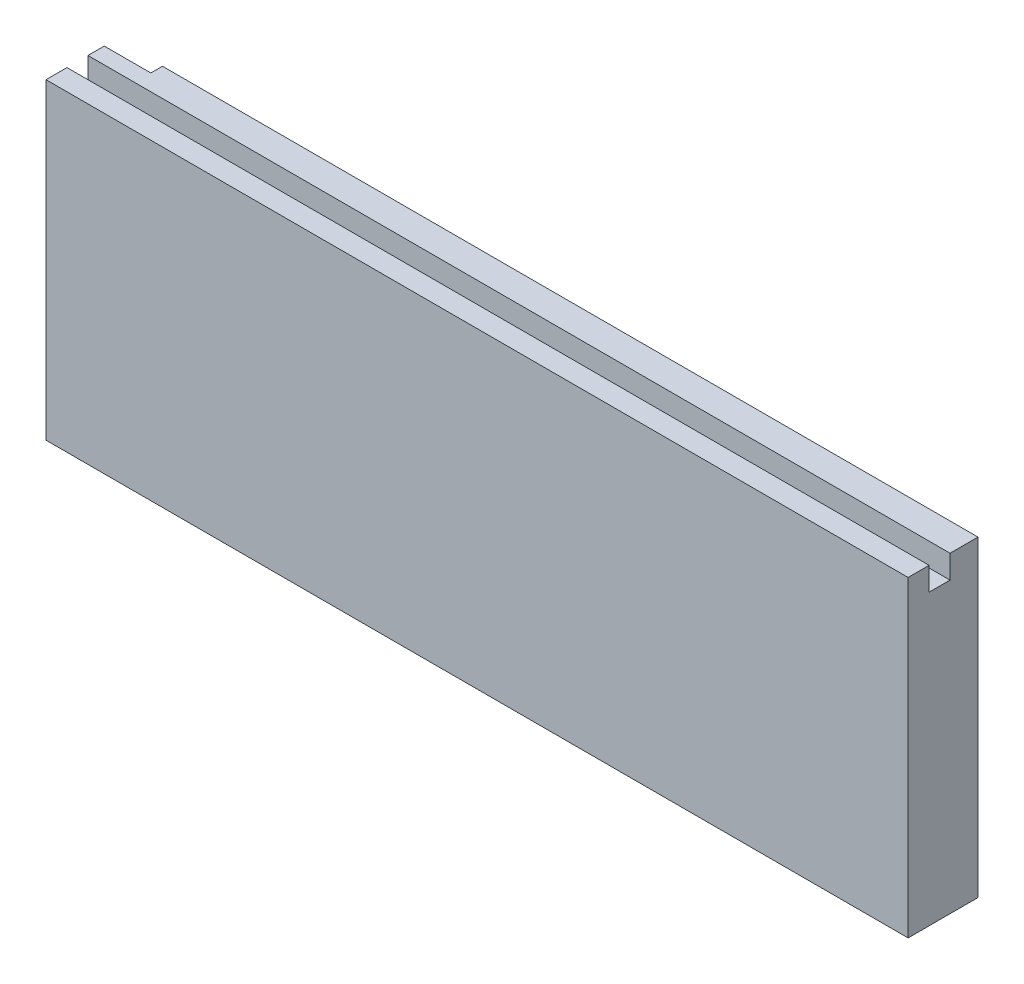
ISO-10303-21;
HEADER;
FILE_DESCRIPTION(('STEP AP214'),'2;1');
FILE_NAME('part.step','',(''),(''),'','','');
FILE_SCHEMA(('AUTOMOTIVE_DESIGN { 1 0 10303 214 1 1 1 1 }'));
ENDSEC;
DATA;
#1=APPLICATION_CONTEXT('core data for automotive mechanical design processes');
#2=APPLICATION_PROTOCOL_DEFINITION('international standard','automotive_design',2000,#1);
#3=PRODUCT_CONTEXT('',#1,'mechanical');
#4=PRODUCT('Part','Part','',(#3));
#5=PRODUCT_RELATED_PRODUCT_CATEGORY('part','',(#4));
#6=PRODUCT_DEFINITION_FORMATION('','',#4);
#7=PRODUCT_DEFINITION_CONTEXT('part definition',#1,'design');
#8=PRODUCT_DEFINITION('design','',#6,#7);
#9=PRODUCT_DEFINITION_SHAPE('','',#8);
#10=(LENGTH_UNIT() NAMED_UNIT(*) SI_UNIT(.MILLI.,.METRE.));
#11=(NAMED_UNIT(*) PLANE_ANGLE_UNIT() SI_UNIT($,.RADIAN.));
#12=(NAMED_UNIT(*) SI_UNIT($,.STERADIAN.) SOLID_ANGLE_UNIT());
#13=UNCERTAINTY_MEASURE_WITH_UNIT(LENGTH_MEASURE(1.E-05),#10,'distance_accuracy_value','');
#14=(GEOMETRIC_REPRESENTATION_CONTEXT(3) GLOBAL_UNCERTAINTY_ASSIGNED_CONTEXT((#13)) GLOBAL_UNIT_ASSIGNED_CONTEXT((#10,
#11,#12)) REPRESENTATION_CONTEXT('',''));
#15=CARTESIAN_POINT('',(0.,0.,0.));
#16=DIRECTION('',(0.,0.,1.));
#17=DIRECTION('',(1.,0.,0.));
#18=AXIS2_PLACEMENT_3D('',#15,#16,#17);
#19=CARTESIAN_POINT('',(0.,49.,38.6780056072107));
#20=CARTESIAN_POINT('',(3.15506832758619,52.1550683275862,38.6780056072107));
#21=CARTESIAN_POINT('',(8.94329847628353,59.3030415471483,38.6780056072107));
#22=CARTESIAN_POINT('',(15.9633545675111,62.,38.6780056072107));
#23=CARTESIAN_POINT('',(25.,62.,38.6780056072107));
#24=B_SPLINE_CURVE_WITH_KNOTS('',3,(#19,#20,#21,#22,#23),.UNSPECIFIED.,.F.,.F.,(4,1,4),(0.,
0.382763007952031,1.),.UNSPECIFIED.);
#25=DIRECTION('',(0.,0.,-1.));
#26=VECTOR('',#25,1.);
#27=SURFACE_OF_LINEAR_EXTRUSION('',#24,#26);
#28=CARTESIAN_POINT('',(0.,49.,6.));
#29=CARTESIAN_POINT('',(3.15506832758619,52.1550683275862,6.));
#30=CARTESIAN_POINT('',(8.94329847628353,59.3030415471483,6.));
#31=CARTESIAN_POINT('',(15.9633545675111,62.,6.));
#32=CARTESIAN_POINT('',(25.,62.,6.));
#33=B_SPLINE_CURVE_WITH_KNOTS('',3,(#28,#29,#30,#31,#32),.UNSPECIFIED.,.F.,.F.,(4,1,4),(0.,
0.382763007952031,1.),.UNSPECIFIED.);
#34=CARTESIAN_POINT('',(16.8108976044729,61.3394728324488,6.));
#35=VERTEX_POINT('',#34);
#36=CARTESIAN_POINT('',(25.,62.,6.));
#37=VERTEX_POINT('',#36);
#38=EDGE_CURVE('E133',#35,#37,#33,.T.);
#39=ORIENTED_EDGE('',*,*,#38,.F.);
#40=DIRECTION('',(0.,0.,-1.));
#41=VECTOR('',#40,1.);
#42=CARTESIAN_POINT('',(16.8108976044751,61.3394728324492,10.5));
#43=LINE('',#42,#41);
#44=CARTESIAN_POINT('',(16.8108976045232,61.3394728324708,10.5));
#45=VERTEX_POINT('',#44);
#46=EDGE_CURVE('E11',#35,#45,#43,.F.);
#47=ORIENTED_EDGE('',*,*,#46,.T.);
#48=CARTESIAN_POINT('',(0.,49.,10.5));
#49=CARTESIAN_POINT('',(3.15506832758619,52.1550683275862,10.5));
#50=CARTESIAN_POINT('',(8.94329847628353,59.3030415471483,10.5));
#51=CARTESIAN_POINT('',(15.9633545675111,62.,10.5));
#52=CARTESIAN_POINT('',(25.,62.,10.5));
#53=B_SPLINE_CURVE_WITH_KNOTS('',3,(#48,#49,#50,#51,#52),.UNSPECIFIED.,.F.,.F.,(4,1,4),(0.,
0.382763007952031,1.),.UNSPECIFIED.);
#54=CARTESIAN_POINT('',(25.,62.,10.5));
#55=VERTEX_POINT('',#54);
#56=EDGE_CURVE('E138',#45,#55,#53,.T.);
#57=ORIENTED_EDGE('',*,*,#56,.T.);
#58=DIRECTION('',(0.,0.,-1.));
#59=VECTOR('',#58,1.);
#60=CARTESIAN_POINT('',(25.,62.,38.6780056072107));
#61=LINE('',#60,#59);
#62=EDGE_CURVE('E267',#55,#37,#61,.T.);
#63=ORIENTED_EDGE('',*,*,#62,.T.);
#64=EDGE_LOOP('',(#39,#47,#57,#63));
#65=FACE_BOUND('',#64,.T.);
#66=ADVANCED_FACE('F33',(#65),#27,.T.);
#67=CARTESIAN_POINT('',(0.,62.,6.));
#68=DIRECTION('',(0.,-1.,0.));
#69=DIRECTION('',(0.,0.,-1.));
#70=AXIS2_PLACEMENT_3D('',#67,#68,#69);
#71=PLANE('',#70);
#72=ORIENTED_EDGE('',*,*,#62,.F.);
#73=DIRECTION('',(1.,0.,0.));
#74=VECTOR('',#73,1.);
#75=CARTESIAN_POINT('',(0.,62.,10.5));
#76=LINE('',#75,#74);
#77=CARTESIAN_POINT('',(185.,62.,10.5));
#78=VERTEX_POINT('',#77);
#79=EDGE_CURVE('E183',#55,#78,#76,.T.);
#80=ORIENTED_EDGE('',*,*,#79,.T.);
#81=DIRECTION('',(0.,0.,-1.));
#82=VECTOR('',#81,1.);
#83=CARTESIAN_POINT('',(185.,62.,6.));
#84=LINE('',#83,#82);
#85=CARTESIAN_POINT('',(185.,62.,6.));
#86=VERTEX_POINT('',#85);
#87=EDGE_CURVE('E173',#78,#86,#84,.T.);
#88=ORIENTED_EDGE('',*,*,#87,.T.);
#89=DIRECTION('',(1.,0.,0.));
#90=VECTOR('',#89,1.);
#91=CARTESIAN_POINT('',(0.,62.,6.));
#92=LINE('',#91,#90);
#93=EDGE_CURVE('E181',#37,#86,#92,.T.);
#94=ORIENTED_EDGE('',*,*,#93,.F.);
#95=EDGE_LOOP('',(#72,#80,#88,#94));
#96=FACE_BOUND('',#95,.T.);
#97=ADVANCED_FACE('F156',(#96),#71,.F.);
#98=CARTESIAN_POINT('',(0.,67.,15.));
#99=DIRECTION('',(0.,-1.,0.));
#100=DIRECTION('',(0.,0.,-1.));
#101=AXIS2_PLACEMENT_3D('',#98,#99,#100);
#102=PLANE('',#101);
#103=DIRECTION('',(0.,0.,-1.));
#104=VECTOR('',#103,1.);
#105=CARTESIAN_POINT('',(0.,67.,15.));
#106=LINE('',#105,#104);
#107=CARTESIAN_POINT('',(0.,67.,6.));
#108=VERTEX_POINT('',#107);
#109=CARTESIAN_POINT('',(0.,67.,2.5));
#110=VERTEX_POINT('',#109);
#111=EDGE_CURVE('E214',#108,#110,#106,.T.);
#112=ORIENTED_EDGE('',*,*,#111,.F.);
#113=DIRECTION('',(1.,0.,0.));
#114=VECTOR('',#113,1.);
#115=CARTESIAN_POINT('',(0.,67.,6.));
#116=LINE('',#115,#114);
#117=CARTESIAN_POINT('',(185.,67.,6.));
#118=VERTEX_POINT('',#117);
#119=EDGE_CURVE('E177',#108,#118,#116,.T.);
#120=ORIENTED_EDGE('',*,*,#119,.T.);
#121=DIRECTION('',(0.,0.,-1.));
#122=VECTOR('',#121,1.);
#123=CARTESIAN_POINT('',(185.,67.,15.));
#124=LINE('',#123,#122);
#125=CARTESIAN_POINT('',(185.,67.,0.));
#126=VERTEX_POINT('',#125);
#127=EDGE_CURVE('E222',#118,#126,#124,.T.);
#128=ORIENTED_EDGE('',*,*,#127,.T.);
#129=DIRECTION('',(-1.,0.,0.));
#130=VECTOR('',#129,1.);
#131=CARTESIAN_POINT('',(0.,67.,0.));
#132=LINE('',#131,#130);
#133=CARTESIAN_POINT('',(10.,67.,0.));
#134=VERTEX_POINT('',#133);
#135=EDGE_CURVE('E208',#126,#134,#132,.T.);
#136=ORIENTED_EDGE('',*,*,#135,.T.);
#137=DIRECTION('',(0.,0.,-1.));
#138=VECTOR('',#137,1.);
#139=CARTESIAN_POINT('',(10.,67.,2.5));
#140=LINE('',#139,#138);
#141=CARTESIAN_POINT('',(10.,67.,2.5));
#142=VERTEX_POINT('',#141);
#143=EDGE_CURVE('E197',#142,#134,#140,.T.);
#144=ORIENTED_EDGE('',*,*,#143,.F.);
#145=DIRECTION('',(1.,0.,0.));
#146=VECTOR('',#145,1.);
#147=CARTESIAN_POINT('',(0.,67.,2.5));
#148=LINE('',#147,#146);
#149=EDGE_CURVE('E189',#110,#142,#148,.T.);
#150=ORIENTED_EDGE('',*,*,#149,.F.);
#151=EDGE_LOOP('',(#112,#120,#128,#136,#144,#150));
#152=FACE_BOUND('',#151,.T.);
#153=ADVANCED_FACE('F241',(#152),#102,.F.);
#154=CARTESIAN_POINT('',(0.,0.,15.));
#155=DIRECTION('',(1.,0.,0.));
#156=DIRECTION('',(0.,0.,-1.));
#157=AXIS2_PLACEMENT_3D('',#154,#155,#156);
#158=PLANE('',#157);
#159=DIRECTION('',(0.,0.,-1.));
#160=VECTOR('',#159,1.);
#161=CARTESIAN_POINT('',(0.,49.,38.6780056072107));
#162=LINE('',#161,#160);
#163=CARTESIAN_POINT('',(0.,49.,10.5));
#164=VERTEX_POINT('',#163);
#165=CARTESIAN_POINT('',(0.,49.,6.));
#166=VERTEX_POINT('',#165);
#167=EDGE_CURVE('E123',#164,#166,#162,.T.);
#168=ORIENTED_EDGE('',*,*,#167,.T.);
#169=DIRECTION('',(0.,1.,0.));
#170=VECTOR('',#169,1.);
#171=CARTESIAN_POINT('',(0.,67.,6.));
#172=LINE('',#171,#170);
#173=EDGE_CURVE('E127',#166,#108,#172,.T.);
#174=ORIENTED_EDGE('',*,*,#173,.T.);
#175=ORIENTED_EDGE('',*,*,#111,.T.);
#176=DIRECTION('',(0.,1.,0.));
#177=VECTOR('',#176,1.);
#178=CARTESIAN_POINT('',(0.,67.,2.5));
#179=LINE('',#178,#177);
#180=CARTESIAN_POINT('',(0.,0.,2.5));
#181=VERTEX_POINT('',#180);
#182=EDGE_CURVE('E186',#181,#110,#179,.T.);
#183=ORIENTED_EDGE('',*,*,#182,.F.);
#184=DIRECTION('',(0.,0.,-1.));
#185=VECTOR('',#184,1.);
#186=CARTESIAN_POINT('',(0.,0.,15.));
#187=LINE('',#186,#185);
#188=CARTESIAN_POINT('',(0.,0.,15.));
#189=VERTEX_POINT('',#188);
#190=EDGE_CURVE('E41',#189,#181,#187,.T.);
#191=ORIENTED_EDGE('',*,*,#190,.F.);
#192=DIRECTION('',(0.,-1.,0.));
#193=VECTOR('',#192,1.);
#194=CARTESIAN_POINT('',(0.,0.,15.));
#195=LINE('',#194,#193);
#196=CARTESIAN_POINT('',(0.,67.,15.));
#197=VERTEX_POINT('',#196);
#198=EDGE_CURVE('E204',#197,#189,#195,.T.);
#199=ORIENTED_EDGE('',*,*,#198,.F.);
#200=CARTESIAN_POINT('',(0.,67.,10.5));
#201=VERTEX_POINT('',#200);
#202=EDGE_CURVE('E126',#197,#201,#106,.T.);
#203=ORIENTED_EDGE('',*,*,#202,.T.);
#204=DIRECTION('',(0.,-1.,0.));
#205=VECTOR('',#204,1.);
#206=CARTESIAN_POINT('',(0.,62.,10.5));
#207=LINE('',#206,#205);
#208=EDGE_CURVE('E56',#201,#164,#207,.T.);
#209=ORIENTED_EDGE('',*,*,#208,.T.);
#210=EDGE_LOOP('',(#168,#174,#175,#183,#191,#199,#203,#209));
#211=FACE_BOUND('',#210,.T.);
#212=ADVANCED_FACE('F35',(#211),#158,.F.);
#213=CARTESIAN_POINT('',(0.,0.,15.));
#214=DIRECTION('',(0.,1.,0.));
#215=DIRECTION('',(0.,0.,1.));
#216=AXIS2_PLACEMENT_3D('',#213,#214,#215);
#217=PLANE('',#216);
#218=DIRECTION('',(-1.,0.,0.));
#219=VECTOR('',#218,1.);
#220=CARTESIAN_POINT('',(0.,0.,2.5));
#221=LINE('',#220,#219);
#222=CARTESIAN_POINT('',(9.99999999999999,0.,2.5));
#223=VERTEX_POINT('',#222);
#224=EDGE_CURVE('E195',#223,#181,#221,.T.);
#225=ORIENTED_EDGE('',*,*,#224,.F.);
#226=DIRECTION('',(0.,0.,-1.));
#227=VECTOR('',#226,1.);
#228=CARTESIAN_POINT('',(9.99999999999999,0.,2.5));
#229=LINE('',#228,#227);
#230=CARTESIAN_POINT('',(9.99999999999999,0.,0.));
#231=VERTEX_POINT('',#230);
#232=EDGE_CURVE('E199',#223,#231,#229,.T.);
#233=ORIENTED_EDGE('',*,*,#232,.T.);
#234=DIRECTION('',(1.,0.,0.));
#235=VECTOR('',#234,1.);
#236=CARTESIAN_POINT('',(0.,0.,0.));
#237=LINE('',#236,#235);
#238=CARTESIAN_POINT('',(185.,0.,0.));
#239=VERTEX_POINT('',#238);
#240=EDGE_CURVE('E202',#231,#239,#237,.T.);
#241=ORIENTED_EDGE('',*,*,#240,.T.);
#242=DIRECTION('',(0.,0.,-1.));
#243=VECTOR('',#242,1.);
#244=CARTESIAN_POINT('',(185.,0.,15.));
#245=LINE('',#244,#243);
#246=CARTESIAN_POINT('',(185.,0.,15.));
#247=VERTEX_POINT('',#246);
#248=EDGE_CURVE('E226',#247,#239,#245,.T.);
#249=ORIENTED_EDGE('',*,*,#248,.F.);
#250=DIRECTION('',(1.,0.,0.));
#251=VECTOR('',#250,1.);
#252=CARTESIAN_POINT('',(0.,0.,15.));
#253=LINE('',#252,#251);
#254=EDGE_CURVE('E207',#189,#247,#253,.T.);
#255=ORIENTED_EDGE('',*,*,#254,.F.);
#256=ORIENTED_EDGE('',*,*,#190,.T.);
#257=EDGE_LOOP('',(#225,#233,#241,#249,#255,#256));
#258=FACE_BOUND('',#257,.T.);
#259=ADVANCED_FACE('F232',(#258),#217,.F.);
#260=CARTESIAN_POINT('',(185.,0.,15.));
#261=DIRECTION('',(-1.,0.,0.));
#262=DIRECTION('',(0.,0.,1.));
#263=AXIS2_PLACEMENT_3D('',#260,#261,#262);
#264=PLANE('',#263);
#265=ORIENTED_EDGE('',*,*,#127,.F.);
#266=DIRECTION('',(0.,1.,0.));
#267=VECTOR('',#266,1.);
#268=CARTESIAN_POINT('',(185.,67.,6.));
#269=LINE('',#268,#267);
#270=EDGE_CURVE('E128',#86,#118,#269,.T.);
#271=ORIENTED_EDGE('',*,*,#270,.F.);
#272=ORIENTED_EDGE('',*,*,#87,.F.);
#273=DIRECTION('',(0.,-1.,0.));
#274=VECTOR('',#273,1.);
#275=CARTESIAN_POINT('',(185.,62.,10.5));
#276=LINE('',#275,#274);
#277=CARTESIAN_POINT('',(185.,67.,10.5));
#278=VERTEX_POINT('',#277);
#279=EDGE_CURVE('E170',#278,#78,#276,.T.);
#280=ORIENTED_EDGE('',*,*,#279,.F.);
#281=CARTESIAN_POINT('',(185.,67.,15.));
#282=VERTEX_POINT('',#281);
#283=EDGE_CURVE('E223',#282,#278,#124,.T.);
#284=ORIENTED_EDGE('',*,*,#283,.F.);
#285=DIRECTION('',(0.,1.,0.));
#286=VECTOR('',#285,1.);
#287=CARTESIAN_POINT('',(185.,0.,15.));
#288=LINE('',#287,#286);
#289=EDGE_CURVE('E210',#247,#282,#288,.T.);
#290=ORIENTED_EDGE('',*,*,#289,.F.);
#291=ORIENTED_EDGE('',*,*,#248,.T.);
#292=DIRECTION('',(0.,1.,0.));
#293=VECTOR('',#292,1.);
#294=CARTESIAN_POINT('',(185.,0.,0.));
#295=LINE('',#294,#293);
#296=EDGE_CURVE('E216',#239,#126,#295,.T.);
#297=ORIENTED_EDGE('',*,*,#296,.T.);
#298=EDGE_LOOP('',(#265,#271,#272,#280,#284,#290,#291,#297));
#299=FACE_BOUND('',#298,.T.);
#300=ADVANCED_FACE('F253',(#299),#264,.F.);
#301=ORIENTED_EDGE('',*,*,#283,.T.);
#302=DIRECTION('',(1.,0.,0.));
#303=VECTOR('',#302,1.);
#304=CARTESIAN_POINT('',(0.,67.,10.5));
#305=LINE('',#304,#303);
#306=EDGE_CURVE('E169',#201,#278,#305,.T.);
#307=ORIENTED_EDGE('',*,*,#306,.F.);
#308=ORIENTED_EDGE('',*,*,#202,.F.);
#309=DIRECTION('',(-1.,0.,0.));
#310=VECTOR('',#309,1.);
#311=CARTESIAN_POINT('',(0.,67.,15.));
#312=LINE('',#311,#310);
#313=EDGE_CURVE('E212',#282,#197,#312,.T.);
#314=ORIENTED_EDGE('',*,*,#313,.F.);
#315=EDGE_LOOP('',(#301,#307,#308,#314));
#316=FACE_BOUND('',#315,.T.);
#317=ADVANCED_FACE('F260',(#316),#102,.F.);
#318=CARTESIAN_POINT('',(0.,0.,15.));
#319=DIRECTION('',(0.,0.,-1.));
#320=DIRECTION('',(-1.,0.,0.));
#321=AXIS2_PLACEMENT_3D('',#318,#319,#320);
#322=PLANE('',#321);
#323=ORIENTED_EDGE('',*,*,#198,.T.);
#324=ORIENTED_EDGE('',*,*,#254,.T.);
#325=ORIENTED_EDGE('',*,*,#289,.T.);
#326=ORIENTED_EDGE('',*,*,#313,.T.);
#327=EDGE_LOOP('',(#323,#324,#325,#326));
#328=FACE_BOUND('',#327,.T.);
#329=ADVANCED_FACE('F258',(#328),#322,.F.);
#330=CARTESIAN_POINT('',(0.,0.,0.));
#331=DIRECTION('',(0.,0.,-1.));
#332=DIRECTION('',(-1.,0.,0.));
#333=AXIS2_PLACEMENT_3D('',#330,#331,#332);
#334=PLANE('',#333);
#335=DIRECTION('',(0.,-1.,0.));
#336=VECTOR('',#335,1.);
#337=CARTESIAN_POINT('',(10.,67.,0.));
#338=LINE('',#337,#336);
#339=EDGE_CURVE('E180',#134,#231,#338,.T.);
#340=ORIENTED_EDGE('',*,*,#339,.F.);
#341=ORIENTED_EDGE('',*,*,#135,.F.);
#342=ORIENTED_EDGE('',*,*,#296,.F.);
#343=ORIENTED_EDGE('',*,*,#240,.F.);
#344=EDGE_LOOP('',(#340,#341,#342,#343));
#345=FACE_BOUND('',#344,.T.);
#346=ADVANCED_FACE('F248',(#345),#334,.T.);
#347=CARTESIAN_POINT('',(10.,67.,2.5));
#348=DIRECTION('',(1.,0.,0.));
#349=DIRECTION('',(0.,1.,0.));
#350=AXIS2_PLACEMENT_3D('',#347,#348,#349);
#351=PLANE('',#350);
#352=ORIENTED_EDGE('',*,*,#339,.T.);
#353=ORIENTED_EDGE('',*,*,#232,.F.);
#354=DIRECTION('',(0.,-1.,0.));
#355=VECTOR('',#354,1.);
#356=CARTESIAN_POINT('',(10.,67.,2.5));
#357=LINE('',#356,#355);
#358=EDGE_CURVE('E192',#142,#223,#357,.T.);
#359=ORIENTED_EDGE('',*,*,#358,.F.);
#360=ORIENTED_EDGE('',*,*,#143,.T.);
#361=EDGE_LOOP('',(#352,#353,#359,#360));
#362=FACE_BOUND('',#361,.T.);
#363=ADVANCED_FACE('F245',(#362),#351,.F.);
#364=CARTESIAN_POINT('',(0.,0.,2.5));
#365=DIRECTION('',(0.,0.,1.));
#366=DIRECTION('',(1.,0.,0.));
#367=AXIS2_PLACEMENT_3D('',#364,#365,#366);
#368=PLANE('',#367);
#369=ORIENTED_EDGE('',*,*,#182,.T.);
#370=ORIENTED_EDGE('',*,*,#149,.T.);
#371=ORIENTED_EDGE('',*,*,#358,.T.);
#372=ORIENTED_EDGE('',*,*,#224,.T.);
#373=EDGE_LOOP('',(#369,#370,#371,#372));
#374=FACE_BOUND('',#373,.T.);
#375=ADVANCED_FACE('F238',(#374),#368,.F.);
#376=CARTESIAN_POINT('',(0.,67.,6.));
#377=DIRECTION('',(0.,0.,-1.));
#378=DIRECTION('',(-1.,0.,0.));
#379=AXIS2_PLACEMENT_3D('',#376,#377,#378);
#380=PLANE('',#379);
#381=ORIENTED_EDGE('',*,*,#173,.F.);
#382=CARTESIAN_POINT('',(0.,49.,6.));
#383=CARTESIAN_POINT('',(9.77385818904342,58.7738581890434,6.));
#384=CARTESIAN_POINT('',(19.5824295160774,65.,6.));
#385=CARTESIAN_POINT('',(35.,65.,6.));
#386=B_SPLINE_CURVE_WITH_KNOTS('',3,(#382,#383,#384,#385),.UNSPECIFIED.,.F.,.F.,(4,4),(0.,1.),.UNSPECIFIED.);
#387=EDGE_CURVE('E48',#166,#35,#386,.T.);
#388=ORIENTED_EDGE('',*,*,#387,.T.);
#389=ORIENTED_EDGE('',*,*,#38,.T.);
#390=ORIENTED_EDGE('',*,*,#93,.T.);
#391=ORIENTED_EDGE('',*,*,#270,.T.);
#392=ORIENTED_EDGE('',*,*,#119,.F.);
#393=EDGE_LOOP('',(#381,#388,#389,#390,#391,#392));
#394=FACE_BOUND('',#393,.T.);
#395=ADVANCED_FACE('F158',(#394),#380,.F.);
#396=CARTESIAN_POINT('',(0.,62.,10.5));
#397=DIRECTION('',(0.,0.,1.));
#398=DIRECTION('',(0.,-1.,0.));
#399=AXIS2_PLACEMENT_3D('',#396,#397,#398);
#400=PLANE('',#399);
#401=ORIENTED_EDGE('',*,*,#56,.F.);
#402=CARTESIAN_POINT('',(0.,49.,10.5));
#403=CARTESIAN_POINT('',(9.77385818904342,58.7738581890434,10.5));
#404=CARTESIAN_POINT('',(19.5824295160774,65.,10.5));
#405=CARTESIAN_POINT('',(35.,65.,10.5));
#406=B_SPLINE_CURVE_WITH_KNOTS('',3,(#402,#403,#404,#405),.UNSPECIFIED.,.F.,.F.,(4,4),(0.,1.),.UNSPECIFIED.);
#407=EDGE_CURVE('E132',#164,#45,#406,.T.);
#408=ORIENTED_EDGE('',*,*,#407,.F.);
#409=ORIENTED_EDGE('',*,*,#208,.F.);
#410=ORIENTED_EDGE('',*,*,#306,.T.);
#411=ORIENTED_EDGE('',*,*,#279,.T.);
#412=ORIENTED_EDGE('',*,*,#79,.F.);
#413=EDGE_LOOP('',(#401,#408,#409,#410,#411,#412));
#414=FACE_BOUND('',#413,.T.);
#415=ADVANCED_FACE('F136',(#414),#400,.F.);
#416=DIRECTION('',(0.,0.,-1.));
#417=VECTOR('',#416,1.);
#418=SURFACE_OF_LINEAR_EXTRUSION('',#406,#417);
#419=ORIENTED_EDGE('',*,*,#387,.F.);
#420=ORIENTED_EDGE('',*,*,#167,.F.);
#421=ORIENTED_EDGE('',*,*,#407,.T.);
#422=ORIENTED_EDGE('',*,*,#46,.F.);
#423=EDGE_LOOP('',(#419,#420,#421,#422));
#424=FACE_BOUND('',#423,.T.);
#425=ADVANCED_FACE('F131',(#424),#418,.T.);
#426=CLOSED_SHELL('',(#66,#97,#153,#212,#259,#300,#317,#329,#346,#363,#375,#395,#415,#425));
#427=MANIFOLD_SOLID_BREP('B2',#426);
#428=ADVANCED_BREP_SHAPE_REPRESENTATION('',(#18,#427),#14);
#429=SHAPE_DEFINITION_REPRESENTATION(#9,#428);
ENDSEC;
END-ISO-10303-21;
